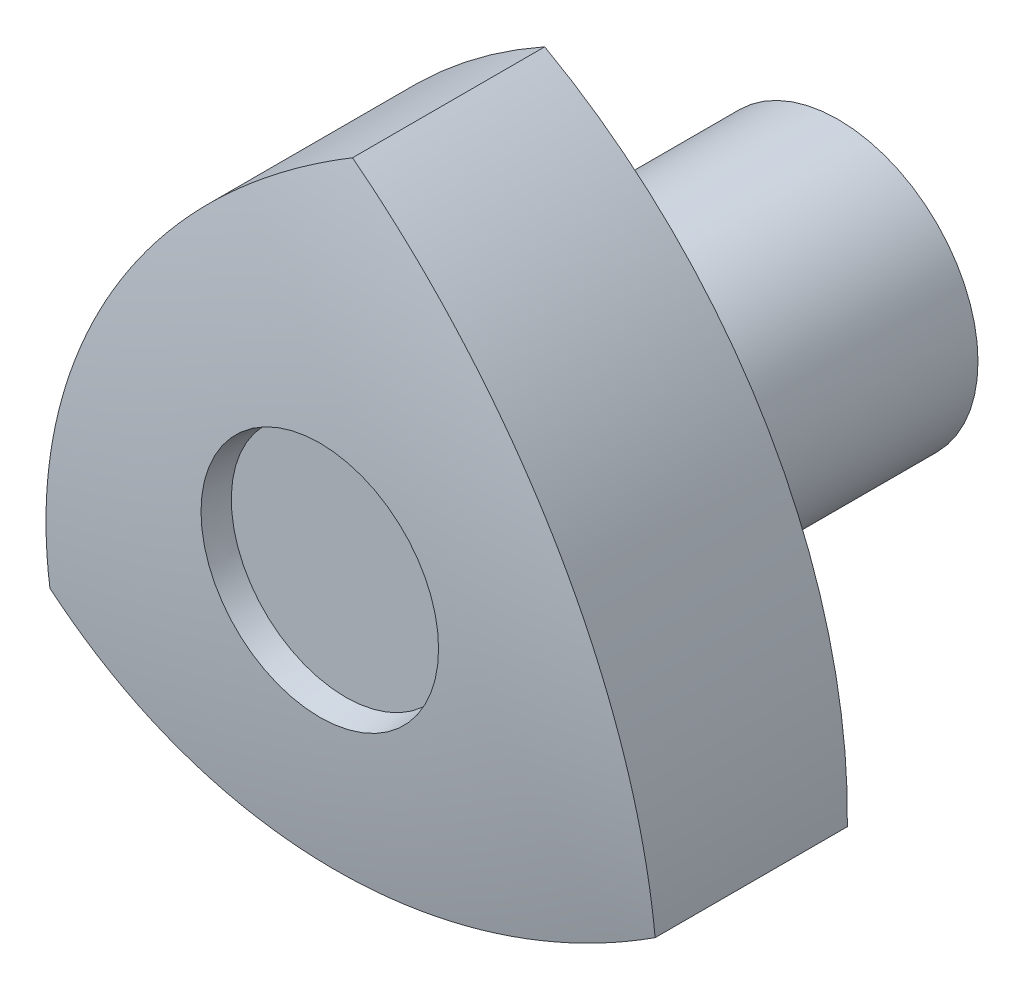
ISO-10303-21;
HEADER;
FILE_DESCRIPTION(('STEP AP214'),'2;1');
FILE_NAME('part.step','',(''),(''),'','','');
FILE_SCHEMA(('AUTOMOTIVE_DESIGN { 1 0 10303 214 1 1 1 1 }'));
ENDSEC;
DATA;
#1=APPLICATION_CONTEXT('core data for automotive mechanical design processes');
#2=APPLICATION_PROTOCOL_DEFINITION('international standard','automotive_design',2000,#1);
#3=PRODUCT_CONTEXT('',#1,'mechanical');
#4=PRODUCT('Part','Part','',(#3));
#5=PRODUCT_RELATED_PRODUCT_CATEGORY('part','',(#4));
#6=PRODUCT_DEFINITION_FORMATION('','',#4);
#7=PRODUCT_DEFINITION_CONTEXT('part definition',#1,'design');
#8=PRODUCT_DEFINITION('design','',#6,#7);
#9=PRODUCT_DEFINITION_SHAPE('','',#8);
#10=(LENGTH_UNIT() NAMED_UNIT(*) SI_UNIT(.MILLI.,.METRE.));
#11=(NAMED_UNIT(*) PLANE_ANGLE_UNIT() SI_UNIT($,.RADIAN.));
#12=(NAMED_UNIT(*) SI_UNIT($,.STERADIAN.) SOLID_ANGLE_UNIT());
#13=UNCERTAINTY_MEASURE_WITH_UNIT(LENGTH_MEASURE(1.E-05),#10,'distance_accuracy_value','');
#14=(GEOMETRIC_REPRESENTATION_CONTEXT(3) GLOBAL_UNCERTAINTY_ASSIGNED_CONTEXT((#13)) GLOBAL_UNIT_ASSIGNED_CONTEXT((#10,
#11,#12)) REPRESENTATION_CONTEXT('',''));
#15=CARTESIAN_POINT('',(0.,0.,0.));
#16=DIRECTION('',(0.,0.,1.));
#17=DIRECTION('',(1.,0.,0.));
#18=AXIS2_PLACEMENT_3D('',#15,#16,#17);
#19=CARTESIAN_POINT('',(0.,-6.53910852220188,28.4));
#20=DIRECTION('',(0.,0.,-1.));
#21=DIRECTION('',(0.,1.,0.));
#22=AXIS2_PLACEMENT_3D('',#19,#20,#21);
#23=PLANE('',#22);
#24=CARTESIAN_POINT('',(0.,0.,28.3999999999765));
#25=DIRECTION('',(0.,0.,1.));
#26=DIRECTION('',(0.,-1.,0.));
#27=AXIS2_PLACEMENT_3D('',#24,#25,#26);
#28=CIRCLE('',#27,6.53910852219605);
#29=CARTESIAN_POINT('',(0.,-6.53910852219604,28.3999999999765));
#30=VERTEX_POINT('',#29);
#31=EDGE_CURVE('E77',#30,#30,#28,.T.);
#32=ORIENTED_EDGE('',*,*,#31,.T.);
#33=EDGE_LOOP('',(#32));
#34=FACE_BOUND('',#33,.T.);
#35=ADVANCED_FACE('F14',(#34),#23,.F.);
#36=CARTESIAN_POINT('',(0.,0.,29.8741626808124));
#37=DIRECTION('',(0.,0.,1.));
#38=DIRECTION('',(0.,-1.,0.));
#39=AXIS2_PLACEMENT_3D('',#36,#37,#38);
#40=CONICAL_SURFACE('',#39,6.79904317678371,0.174532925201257);
#41=CARTESIAN_POINT('',(0.,0.,29.874162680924));
#42=DIRECTION('',(0.,0.,-1.));
#43=DIRECTION('',(0.,1.,0.));
#44=AXIS2_PLACEMENT_3D('',#41,#42,#43);
#45=CIRCLE('',#44,6.79904317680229);
#46=CARTESIAN_POINT('',(0.,6.7990431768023,29.874162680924));
#47=VERTEX_POINT('',#46);
#48=EDGE_CURVE('E59',#47,#47,#45,.T.);
#49=ORIENTED_EDGE('',*,*,#48,.F.);
#50=EDGE_LOOP('',(#49));
#51=FACE_BOUND('',#50,.T.);
#52=ORIENTED_EDGE('',*,*,#31,.F.);
#53=EDGE_LOOP('',(#52));
#54=FACE_BOUND('',#53,.T.);
#55=ADVANCED_FACE('F172',(#51,#54),#40,.F.);
#56=CARTESIAN_POINT('',(0.,0.,-52.2083333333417));
#57=DIRECTION('',(0.,0.,1.));
#58=DIRECTION('',(0.,-1.,0.));
#59=AXIS2_PLACEMENT_3D('',#56,#57,#58);
#60=DEGENERATE_TOROIDAL_SURFACE('',#59,1.87916666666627,82.2298080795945,.T.);
#61=ORIENTED_EDGE('',*,*,#48,.T.);
#62=EDGE_LOOP('',(#61));
#63=FACE_BOUND('',#62,.T.);
#64=CARTESIAN_POINT('',(3.39948456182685E-13,20.,28.));
#65=CARTESIAN_POINT('',(0.372642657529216,19.7932630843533,28.0467066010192));
#66=CARTESIAN_POINT('',(0.741471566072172,19.5793830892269,28.0918331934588));
#67=CARTESIAN_POINT('',(1.47101156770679,19.1375865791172,28.1788947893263));
#68=CARTESIAN_POINT('',(1.83172263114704,18.9096700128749,28.2208297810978));
#69=CARTESIAN_POINT('',(2.90076609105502,18.2053565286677,28.3417798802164));
#70=CARTESIAN_POINT('',(3.59619057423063,17.708294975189,28.4159628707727));
#71=CARTESIAN_POINT('',(4.94790509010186,16.6620571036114,28.5511708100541));
#72=CARTESIAN_POINT('',(5.60419538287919,16.1128811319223,28.6121958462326));
#73=CARTESIAN_POINT('',(6.87366086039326,14.9654936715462,28.7209726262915));
#74=CARTESIAN_POINT('',(7.48683405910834,14.3672799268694,28.7687237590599));
#75=CARTESIAN_POINT('',(8.71865863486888,13.0700716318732,28.8545535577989));
#76=CARTESIAN_POINT('',(9.33294869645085,12.3668456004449,28.8913945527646));
#77=CARTESIAN_POINT('',(10.5012836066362,10.9113370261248,28.9492833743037));
#78=CARTESIAN_POINT('',(11.0553238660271,10.1590507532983,28.9703299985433));
#79=CARTESIAN_POINT('',(12.0991453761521,8.61069429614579,28.9966653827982));
#80=CARTESIAN_POINT('',(12.5889158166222,7.8146167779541,29.0019514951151));
#81=CARTESIAN_POINT('',(13.5005090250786,6.18456766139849,28.9967711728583));
#82=CARTESIAN_POINT('',(13.9223353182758,5.35059803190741,28.9863055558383));
#83=CARTESIAN_POINT('',(14.6927195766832,3.65593233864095,28.9497108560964));
#84=CARTESIAN_POINT('',(15.041707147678,2.79542945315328,28.9236773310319));
#85=CARTESIAN_POINT('',(15.6672761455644,1.04897441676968,28.8559880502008));
#86=CARTESIAN_POINT('',(15.943849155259,0.163019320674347,28.8143304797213));
#87=CARTESIAN_POINT('',(16.4224738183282,-1.62689638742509,28.7154571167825));
#88=CARTESIAN_POINT('',(16.6246054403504,-2.530836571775,28.6582581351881));
#89=CARTESIAN_POINT('',(16.9534969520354,-4.3508712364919,28.5284012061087));
#90=CARTESIAN_POINT('',(17.080291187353,-5.26695998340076,28.4557503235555));
#91=CARTESIAN_POINT('',(17.2305634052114,-6.82078728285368,28.3200368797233));
#92=CARTESIAN_POINT('',(17.2738628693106,-7.45703003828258,28.2609528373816));
#93=CARTESIAN_POINT('',(17.3242365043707,-8.72906049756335,28.1357415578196));
#94=CARTESIAN_POINT('',(17.3313778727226,-9.36484684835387,28.0696276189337));
#95=CARTESIAN_POINT('',(17.3205080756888,-9.99999999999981,28.));
#96=B_SPLINE_CURVE_WITH_KNOTS('',3,(#64,#65,#66,#67,#68,#69,#70,#71,#72,#73,#74,#75,#76,#77,#78,
#79,#80,#81,#82,#83,#84,#85,#86,#87,#88,#89,#90,#91,#92,#93,#94,#95),.UNSPECIFIED.,.F.,.F.,(4,2,
2,2,2,2,2,2,2,2,2,2,2,2,2,4),(0.,1.28593682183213,2.57187833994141,5.14313559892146,
7.71437576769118,10.2857342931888,13.0857434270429,15.8859656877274,18.6866583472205,
21.4872056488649,24.2707368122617,27.0545913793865,29.835446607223,32.6150330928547,
34.5353707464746,36.4521382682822),.UNSPECIFIED.);
#97=CARTESIAN_POINT('',(2.76315982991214E-13,20.,28.));
#98=VERTEX_POINT('',#97);
#99=CARTESIAN_POINT('',(17.3205080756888,-9.9999999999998,28.));
#100=VERTEX_POINT('',#99);
#101=EDGE_CURVE('E49',#98,#100,#96,.T.);
#102=ORIENTED_EDGE('',*,*,#101,.F.);
#103=CARTESIAN_POINT('',(-17.3205080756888,-9.99999999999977,28.));
#104=CARTESIAN_POINT('',(-17.3277899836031,-9.57391353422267,28.0467066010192));
#105=CARTESIAN_POINT('',(-17.3269789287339,-9.1475583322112,28.0918331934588));
#106=CARTESIAN_POINT('',(-17.3091419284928,-8.29485990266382,28.1788947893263));
#107=CARTESIAN_POINT('',(-17.2921159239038,-7.86851667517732,28.2208297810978));
#108=CARTESIAN_POINT('',(-17.2166842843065,-6.5905411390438,28.3417798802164));
#109=CARTESIAN_POINT('',(-17.1339285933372,-5.73975509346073,28.4159628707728));
#110=CARTESIAN_POINT('',(-16.9037172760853,-4.04601704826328,28.5511708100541));
#111=CARTESIAN_POINT('',(-16.7562620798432,-3.20306499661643,28.6121958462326));
#112=CARTESIAN_POINT('',(-16.3973281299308,-1.52998191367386,28.7209726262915));
#113=CARTESIAN_POINT('',(-16.1858464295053,-0.699851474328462,28.7687237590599));
#114=CARTESIAN_POINT('',(-15.6783433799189,1.0155440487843,28.8545535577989));
#115=CARTESIAN_POINT('',(-15.3764768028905,1.89914786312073,28.8913945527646));
#116=CARTESIAN_POINT('',(-14.7001368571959,3.6387098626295,28.9492833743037));
#117=CARTESIAN_POINT('',(-14.3256579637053,4.49466593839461,28.9703299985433));
#118=CARTESIAN_POINT('',(-13.5066526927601,6.17282011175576,28.9966653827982));
#119=CARTESIAN_POINT('',(-13.0621145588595,6.99501251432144,29.0019514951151));
#120=CARTESIAN_POINT('',(-12.1062472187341,8.59949994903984,28.9967711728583));
#121=CARTESIAN_POINT('',(-11.5949214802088,9.38179704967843,28.9863055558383));
#122=CARTESIAN_POINT('',(-10.5124900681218,10.8963022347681,28.9497108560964));
#123=CARTESIAN_POINT('',(-9.94176649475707,11.6287857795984,28.9236773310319));
#124=CARTESIAN_POINT('',(-8.74207656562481,13.0437719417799,28.8559880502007));
#125=CARTESIAN_POINT('',(-8.11310345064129,13.7262687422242,28.8143304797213));
#126=CARTESIAN_POINT('',(-6.80230330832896,15.0357277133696,28.7154571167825));
#127=CARTESIAN_POINT('',(-6.12053395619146,15.662748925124,28.658258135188));
#128=CARTESIAN_POINT('',(-4.70878345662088,16.8575946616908,28.5284012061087));
#129=CARTESIAN_POINT('',(-3.97882444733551,17.4254460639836,28.4557503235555));
#130=CARTESIAN_POINT('',(-2.70830664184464,18.3324992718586,28.3200368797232));
#131=CARTESIAN_POINT('',(-2.17895398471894,18.6881190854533,28.2609528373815));
#132=CARTESIAN_POINT('',(-1.10253011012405,19.3677591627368,28.1357415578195));
#133=CARTESIAN_POINT('',(-0.555493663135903,19.6918369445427,28.0696276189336));
#134=CARTESIAN_POINT('',(2.85657476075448E-13,20.0000000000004,28.));
#135=B_SPLINE_CURVE_WITH_KNOTS('',3,(#103,#104,#105,#106,#107,#108,#109,#110,#111,#112,#113,
#114,#115,#116,#117,#118,#119,#120,#121,#122,#123,#124,#125,#126,#127,#128,#129,#130,#131,#132,
#133,#134),.UNSPECIFIED.,.F.,.F.,(4,2,2,2,2,2,2,2,2,2,2,2,2,2,2,4),(0.,1.28593682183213,
2.57187833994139,5.14313559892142,7.71437576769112,10.2857342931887,13.0857434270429,
15.8859656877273,18.6866583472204,21.4872056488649,24.2707368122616,27.0545913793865,
29.835446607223,32.6150330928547,34.5353707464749,36.4521382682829),.UNSPECIFIED.);
#136=CARTESIAN_POINT('',(-17.3205080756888,-9.99999999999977,28.));
#137=VERTEX_POINT('',#136);
#138=EDGE_CURVE('E58',#137,#98,#135,.T.);
#139=ORIENTED_EDGE('',*,*,#138,.F.);
#140=CARTESIAN_POINT('',(17.3205080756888,-9.99999999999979,28.));
#141=CARTESIAN_POINT('',(16.9551473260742,-10.2193495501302,28.0467066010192));
#142=CARTESIAN_POINT('',(16.585507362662,-10.4318247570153,28.0918331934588));
#143=CARTESIAN_POINT('',(15.8381303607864,-10.842726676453,28.1788947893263));
#144=CARTESIAN_POINT('',(15.4603932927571,-11.0411533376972,28.2208297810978));
#145=CARTESIAN_POINT('',(14.3159181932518,-11.6148153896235,28.3417798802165));
#146=CARTESIAN_POINT('',(13.5377380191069,-11.9685398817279,28.4159628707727));
#147=CARTESIAN_POINT('',(11.9558121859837,-12.6160400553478,28.5511708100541));
#148=CARTESIAN_POINT('',(11.1520666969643,-12.9098161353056,28.6121958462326));
#149=CARTESIAN_POINT('',(9.52366726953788,-13.435511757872,28.7209726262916));
#150=CARTESIAN_POINT('',(8.69901237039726,-13.6674284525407,28.7687237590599));
#151=CARTESIAN_POINT('',(6.95968474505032,-14.0856156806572,28.8545535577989));
#152=CARTESIAN_POINT('',(6.04352810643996,-14.2659934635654,28.8913945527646));
#153=CARTESIAN_POINT('',(4.19885325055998,-14.550046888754,28.9492833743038));
#154=CARTESIAN_POINT('',(3.2703340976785,-14.6537166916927,28.9703299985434));
#155=CARTESIAN_POINT('',(1.40750731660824,-14.7835144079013,28.9966653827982));
#156=CARTESIAN_POINT('',(0.473198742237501,-14.8096292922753,29.0019514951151));
#157=CARTESIAN_POINT('',(-1.39426180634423,-14.7840676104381,28.9967711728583));
#158=CARTESIAN_POINT('',(-2.32741383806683,-14.7323950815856,28.9863055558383));
#159=CARTESIAN_POINT('',(-4.18022950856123,-14.5522345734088,28.9497108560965));
#160=CARTESIAN_POINT('',(-5.09994065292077,-14.4242152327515,28.923677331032));
#161=CARTESIAN_POINT('',(-6.92519957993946,-14.0927463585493,28.8559880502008));
#162=CARTESIAN_POINT('',(-7.83074570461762,-13.8892880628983,28.8143304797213));
#163=CARTESIAN_POINT('',(-9.62017050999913,-13.4088313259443,28.7154571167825));
#164=CARTESIAN_POINT('',(-10.5040714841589,-13.1319123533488,28.6582581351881));
#165=CARTESIAN_POINT('',(-12.2447134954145,-12.5067234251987,28.5284012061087));
#166=CARTESIAN_POINT('',(-13.1014667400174,-12.1584860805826,28.4557503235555));
#167=CARTESIAN_POINT('',(-14.5222567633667,-11.5117119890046,28.3200368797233));
#168=CARTESIAN_POINT('',(-15.0949088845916,-11.2310890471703,28.2609528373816));
#169=CARTESIAN_POINT('',(-16.2217063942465,-10.6386986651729,28.1357415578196));
#170=CARTESIAN_POINT('',(-16.7758842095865,-10.3269900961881,28.0696276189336));
#171=CARTESIAN_POINT('',(-17.3205080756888,-9.99999999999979,28.));
#172=B_SPLINE_CURVE_WITH_KNOTS('',3,(#140,#141,#142,#143,#144,#145,#146,#147,#148,#149,#150,
#151,#152,#153,#154,#155,#156,#157,#158,#159,#160,#161,#162,#163,#164,#165,#166,#167,#168,#169,
#170,#171),.UNSPECIFIED.,.F.,.F.,(4,2,2,2,2,2,2,2,2,2,2,2,2,2,2,4),(0.,1.28593682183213,
2.57187833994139,5.14313559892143,7.71437576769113,10.2857342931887,13.0857434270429,
15.8859656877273,18.6866583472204,21.4872056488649,24.2707368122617,27.0545913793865,
29.835446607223,32.6150330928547,34.5353707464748,36.4521382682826),.UNSPECIFIED.);
#173=EDGE_CURVE('E62',#100,#137,#172,.T.);
#174=ORIENTED_EDGE('',*,*,#173,.F.);
#175=EDGE_LOOP('',(#102,#139,#174));
#176=FACE_BOUND('',#175,.T.);
#177=ADVANCED_FACE('F16',(#63,#176),#60,.T.);
#178=CARTESIAN_POINT('',(0.,-4.0000000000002,0.));
#179=DIRECTION('',(0.,0.,1.));
#180=DIRECTION('',(0.,-1.,0.));
#181=AXIS2_PLACEMENT_3D('',#178,#179,#180);
#182=PLANE('',#181);
#183=CARTESIAN_POINT('',(0.,0.,0.));
#184=DIRECTION('',(0.,0.,-1.));
#185=DIRECTION('',(-1.,0.,0.));
#186=AXIS2_PLACEMENT_3D('',#183,#184,#185);
#187=CIRCLE('',#186,4.);
#188=CARTESIAN_POINT('',(-4.,0.,0.));
#189=VERTEX_POINT('',#188);
#190=EDGE_CURVE('E128',#189,#189,#187,.T.);
#191=ORIENTED_EDGE('',*,*,#190,.F.);
#192=EDGE_LOOP('',(#191));
#193=FACE_BOUND('',#192,.T.);
#194=CARTESIAN_POINT('',(0.,0.,0.));
#195=DIRECTION('',(0.,0.,-1.));
#196=DIRECTION('',(0.,1.,0.));
#197=AXIS2_PLACEMENT_3D('',#194,#195,#196);
#198=CIRCLE('',#197,5.20000000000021);
#199=CARTESIAN_POINT('',(0.,5.20000000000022,0.));
#200=VERTEX_POINT('',#199);
#201=EDGE_CURVE('E89',#200,#200,#198,.F.);
#202=ORIENTED_EDGE('',*,*,#201,.F.);
#203=EDGE_LOOP('',(#202));
#204=FACE_BOUND('',#203,.T.);
#205=ADVANCED_FACE('F114',(#193,#204),#182,.F.);
#206=CARTESIAN_POINT('',(-16.3245788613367,-9.42499999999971,40.));
#207=DIRECTION('',(0.,0.,1.));
#208=DIRECTION('',(-1.,0.,0.));
#209=AXIS2_PLACEMENT_3D('',#206,#207,#208);
#210=CYLINDRICAL_SURFACE('',#209,33.65);
#211=DIRECTION('',(0.,0.,1.));
#212=VECTOR('',#211,1.);
#213=CARTESIAN_POINT('',(17.3205080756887,-9.99999999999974,40.));
#214=LINE('',#213,#212);
#215=CARTESIAN_POINT('',(17.3205080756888,-10.,17.));
#216=VERTEX_POINT('',#215);
#217=EDGE_CURVE('E54',#216,#100,#214,.T.);
#218=ORIENTED_EDGE('',*,*,#217,.F.);
#219=CARTESIAN_POINT('',(-16.3245788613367,-9.42499999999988,17.));
#220=DIRECTION('',(0.,0.,1.));
#221=DIRECTION('',(-1.,0.,0.));
#222=AXIS2_PLACEMENT_3D('',#219,#220,#221);
#223=CIRCLE('',#222,33.65);
#224=CARTESIAN_POINT('',(1.02348685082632E-13,20.,17.));
#225=VERTEX_POINT('',#224);
#226=EDGE_CURVE('E87',#216,#225,#223,.T.);
#227=ORIENTED_EDGE('',*,*,#226,.T.);
#228=DIRECTION('',(0.,0.,1.));
#229=VECTOR('',#228,1.);
#230=CARTESIAN_POINT('',(2.1163626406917E-13,20.0000000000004,40.));
#231=LINE('',#230,#229);
#232=EDGE_CURVE('E56',#98,#225,#231,.F.);
#233=ORIENTED_EDGE('',*,*,#232,.F.);
#234=ORIENTED_EDGE('',*,*,#101,.T.);
#235=EDGE_LOOP('',(#218,#227,#233,#234));
#236=FACE_BOUND('',#235,.T.);
#237=ADVANCED_FACE('F52',(#236),#210,.T.);
#238=CARTESIAN_POINT('',(16.3245788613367,-9.4249999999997,40.));
#239=DIRECTION('',(0.,0.,1.));
#240=DIRECTION('',(-1.,0.,0.));
#241=AXIS2_PLACEMENT_3D('',#238,#239,#240);
#242=CYLINDRICAL_SURFACE('',#241,33.65);
#243=ORIENTED_EDGE('',*,*,#232,.T.);
#244=CARTESIAN_POINT('',(16.3245788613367,-9.42499999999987,17.0000000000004));
#245=DIRECTION('',(0.,0.,1.));
#246=DIRECTION('',(-1.,0.,0.));
#247=AXIS2_PLACEMENT_3D('',#244,#245,#246);
#248=CIRCLE('',#247,33.65);
#249=CARTESIAN_POINT('',(-17.3205080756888,-9.99999999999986,17.0000000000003));
#250=VERTEX_POINT('',#249);
#251=EDGE_CURVE('E34',#225,#250,#248,.T.);
#252=ORIENTED_EDGE('',*,*,#251,.T.);
#253=DIRECTION('',(0.,0.,1.));
#254=VECTOR('',#253,1.);
#255=CARTESIAN_POINT('',(-17.3205080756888,-9.99999999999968,40.));
#256=LINE('',#255,#254);
#257=EDGE_CURVE('E64',#137,#250,#256,.F.);
#258=ORIENTED_EDGE('',*,*,#257,.F.);
#259=ORIENTED_EDGE('',*,*,#138,.T.);
#260=EDGE_LOOP('',(#243,#252,#258,#259));
#261=FACE_BOUND('',#260,.T.);
#262=ADVANCED_FACE('F106',(#261),#242,.T.);
#263=CARTESIAN_POINT('',(0.,18.8500000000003,40.));
#264=DIRECTION('',(0.,0.,1.));
#265=DIRECTION('',(-1.,0.,0.));
#266=AXIS2_PLACEMENT_3D('',#263,#264,#265);
#267=CYLINDRICAL_SURFACE('',#266,33.65);
#268=ORIENTED_EDGE('',*,*,#173,.T.);
#269=ORIENTED_EDGE('',*,*,#257,.T.);
#270=CARTESIAN_POINT('',(0.,18.85,17.));
#271=DIRECTION('',(0.,0.,1.));
#272=DIRECTION('',(-1.,0.,0.));
#273=AXIS2_PLACEMENT_3D('',#270,#271,#272);
#274=CIRCLE('',#273,33.65);
#275=EDGE_CURVE('E68',#250,#216,#274,.T.);
#276=ORIENTED_EDGE('',*,*,#275,.T.);
#277=ORIENTED_EDGE('',*,*,#217,.T.);
#278=EDGE_LOOP('',(#268,#269,#276,#277));
#279=FACE_BOUND('',#278,.T.);
#280=ADVANCED_FACE('F66',(#279),#267,.T.);
#281=CARTESIAN_POINT('',(0.,0.,28.4));
#282=DIRECTION('',(0.,0.,-1.));
#283=DIRECTION('',(0.,1.,0.));
#284=AXIS2_PLACEMENT_3D('',#281,#282,#283);
#285=CYLINDRICAL_SURFACE('',#284,5.20000000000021);
#286=ORIENTED_EDGE('',*,*,#201,.T.);
#287=EDGE_LOOP('',(#286));
#288=FACE_BOUND('',#287,.T.);
#289=CARTESIAN_POINT('',(0.,0.,0.200000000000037));
#290=DIRECTION('',(0.,0.,-1.));
#291=DIRECTION('',(0.,1.,0.));
#292=AXIS2_PLACEMENT_3D('',#289,#290,#291);
#293=CIRCLE('',#292,5.20000000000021);
#294=CARTESIAN_POINT('',(0.,5.20000000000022,0.200000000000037));
#295=VERTEX_POINT('',#294);
#296=EDGE_CURVE('E82',#295,#295,#293,.T.);
#297=ORIENTED_EDGE('',*,*,#296,.T.);
#298=EDGE_LOOP('',(#297));
#299=FACE_BOUND('',#298,.T.);
#300=ADVANCED_FACE('F105',(#288,#299),#285,.T.);
#301=CARTESIAN_POINT('',(0.,-8.,17.));
#302=DIRECTION('',(0.,0.,1.));
#303=DIRECTION('',(0.,-1.,0.));
#304=AXIS2_PLACEMENT_3D('',#301,#302,#303);
#305=PLANE('',#304);
#306=CARTESIAN_POINT('',(0.,0.,17.));
#307=DIRECTION('',(0.,0.,-1.));
#308=DIRECTION('',(0.,1.,0.));
#309=AXIS2_PLACEMENT_3D('',#306,#307,#308);
#310=CIRCLE('',#309,8.00000000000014);
#311=CARTESIAN_POINT('',(0.,8.00000000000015,17.));
#312=VERTEX_POINT('',#311);
#313=EDGE_CURVE('E25',#312,#312,#310,.T.);
#314=ORIENTED_EDGE('',*,*,#313,.F.);
#315=EDGE_LOOP('',(#314));
#316=FACE_BOUND('',#315,.T.);
#317=ORIENTED_EDGE('',*,*,#251,.F.);
#318=ORIENTED_EDGE('',*,*,#226,.F.);
#319=ORIENTED_EDGE('',*,*,#275,.F.);
#320=EDGE_LOOP('',(#317,#318,#319));
#321=FACE_BOUND('',#320,.T.);
#322=ADVANCED_FACE('F143',(#316,#321),#305,.F.);
#323=CARTESIAN_POINT('',(0.,-5.2000000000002,0.200000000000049));
#324=DIRECTION('',(0.,0.,1.));
#325=DIRECTION('',(0.,-1.,0.));
#326=AXIS2_PLACEMENT_3D('',#323,#324,#325);
#327=PLANE('',#326);
#328=ORIENTED_EDGE('',*,*,#296,.F.);
#329=EDGE_LOOP('',(#328));
#330=FACE_BOUND('',#329,.T.);
#331=CARTESIAN_POINT('',(0.,0.,0.200000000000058));
#332=DIRECTION('',(0.,0.,-1.));
#333=DIRECTION('',(0.,1.,0.));
#334=AXIS2_PLACEMENT_3D('',#331,#332,#333);
#335=CIRCLE('',#334,8.00000000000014);
#336=CARTESIAN_POINT('',(0.,8.00000000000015,0.200000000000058));
#337=VERTEX_POINT('',#336);
#338=EDGE_CURVE('E9',#337,#337,#335,.F.);
#339=ORIENTED_EDGE('',*,*,#338,.F.);
#340=EDGE_LOOP('',(#339));
#341=FACE_BOUND('',#340,.T.);
#342=ADVANCED_FACE('F146',(#330,#341),#327,.F.);
#343=CARTESIAN_POINT('',(0.,0.,28.4));
#344=DIRECTION('',(0.,0.,-1.));
#345=DIRECTION('',(0.,1.,0.));
#346=AXIS2_PLACEMENT_3D('',#343,#344,#345);
#347=CYLINDRICAL_SURFACE('',#346,8.00000000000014);
#348=ORIENTED_EDGE('',*,*,#338,.T.);
#349=EDGE_LOOP('',(#348));
#350=FACE_BOUND('',#349,.T.);
#351=ORIENTED_EDGE('',*,*,#313,.T.);
#352=EDGE_LOOP('',(#351));
#353=FACE_BOUND('',#352,.T.);
#354=ADVANCED_FACE('F149',(#350,#353),#347,.T.);
#355=CARTESIAN_POINT('',(0.,0.,14.));
#356=DIRECTION('',(0.,0.,-1.));
#357=DIRECTION('',(-1.,0.,0.));
#358=AXIS2_PLACEMENT_3D('',#355,#356,#357);
#359=CYLINDRICAL_SURFACE('',#358,4.);
#360=CARTESIAN_POINT('',(0.,0.,14.));
#361=DIRECTION('',(0.,0.,-1.));
#362=DIRECTION('',(-1.,0.,0.));
#363=AXIS2_PLACEMENT_3D('',#360,#361,#362);
#364=CIRCLE('',#363,4.);
#365=CARTESIAN_POINT('',(-4.,0.,14.));
#366=VERTEX_POINT('',#365);
#367=EDGE_CURVE('E124',#366,#366,#364,.T.);
#368=ORIENTED_EDGE('',*,*,#367,.F.);
#369=EDGE_LOOP('',(#368));
#370=FACE_BOUND('',#369,.T.);
#371=ORIENTED_EDGE('',*,*,#190,.T.);
#372=EDGE_LOOP('',(#371));
#373=FACE_BOUND('',#372,.T.);
#374=ADVANCED_FACE('F135',(#370,#373),#359,.F.);
#375=CARTESIAN_POINT('',(0.,0.,27.3333333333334));
#376=DIRECTION('',(0.,0.,1.));
#377=DIRECTION('',(0.,-1.,0.));
#378=AXIS2_PLACEMENT_3D('',#375,#376,#377);
#379=PLANE('',#378);
#380=CARTESIAN_POINT('',(0.,0.,27.3333333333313));
#381=DIRECTION('',(0.,0.,1.));
#382=DIRECTION('',(0.,-1.,0.));
#383=AXIS2_PLACEMENT_3D('',#380,#381,#382);
#384=CIRCLE('',#383,6.35102640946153);
#385=CARTESIAN_POINT('',(0.,-6.35102640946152,27.3333333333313));
#386=VERTEX_POINT('',#385);
#387=EDGE_CURVE('E19',#386,#386,#384,.F.);
#388=ORIENTED_EDGE('',*,*,#387,.T.);
#389=EDGE_LOOP('',(#388));
#390=FACE_BOUND('',#389,.T.);
#391=ADVANCED_FACE('F165',(#390),#379,.F.);
#392=CARTESIAN_POINT('',(0.,0.,27.3333333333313));
#393=DIRECTION('',(0.,0.,1.));
#394=DIRECTION('',(0.,-1.,0.));
#395=AXIS2_PLACEMENT_3D('',#392,#393,#394);
#396=CONICAL_SURFACE('',#395,6.35102640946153,0.174532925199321);
#397=ORIENTED_EDGE('',*,*,#387,.F.);
#398=EDGE_LOOP('',(#397));
#399=FACE_BOUND('',#398,.T.);
#400=ORIENTED_EDGE('',*,*,#367,.T.);
#401=EDGE_LOOP('',(#400));
#402=FACE_BOUND('',#401,.T.);
#403=ADVANCED_FACE('F170',(#399,#402),#396,.F.);
#404=CLOSED_SHELL('',(#35,#55,#177,#205,#237,#262,#280,#300,#322,#342,#354,#374,#391,#403));
#405=MANIFOLD_SOLID_BREP('B1',#404);
#406=ADVANCED_BREP_SHAPE_REPRESENTATION('',(#18,#405),#14);
#407=SHAPE_DEFINITION_REPRESENTATION(#9,#406);
ENDSEC;
END-ISO-10303-21;
